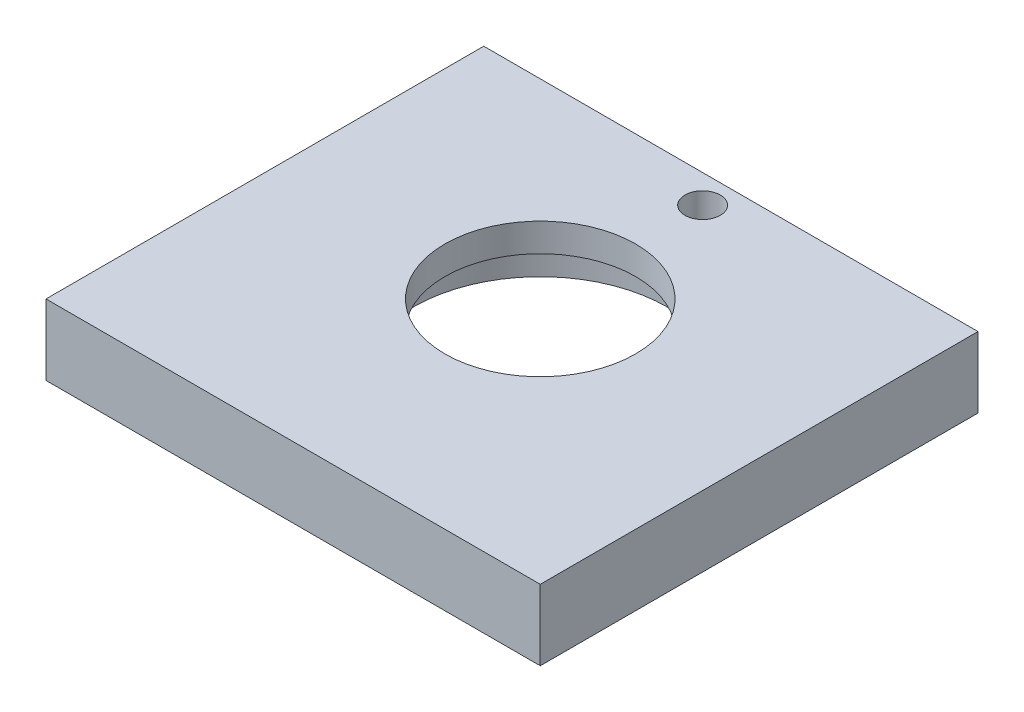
from build123d import *

# Parameters (mm, degrees)
ESQUISSE1_W               = 70
ESQUISSE1_H               = 10
BOSS_EXTRU_1_DEPTH        = 62
ESQUISSE2_R               = 13.5
ESQUISSE2_R_2             = 2.5
ENL_V_MAT_EXTRU_1_DEPTH   = 62
TROU_TARAUD_M5X0_81_D     = 4.2
TROU_TARAUD_M5X0_81_DEPTH = 15
TROU_TARAUD_M5X0_81_TIP   = 1.2618073
ESQUISSE5_R               = 18
ENL_V_MAT_EXTRU_2_DEPTH   = 6


with BuildPart() as part:
    # Esquisse1 → Boss.-Extru.1 (new body)
    with BuildSketch(Plane.XY):
        with Locations((-45, 130)):
            Rectangle(ESQUISSE1_W, ESQUISSE1_H)
    extrude(amount=BOSS_EXTRU_1_DEPTH)

    # Esquisse2 → Enl_v. mat.-Extru.1 (cut)
    with BuildSketch(Plane(origin=(0, 135, 0), x_dir=(1, 0, 0), z_dir=(0, 1, 0))):
        with Locations(Location((-45, -27, 0), (0, 0, 270))):
            Circle(ESQUISSE2_R)
        with Locations(Location((-45, -4, 0), (0, 0, 270))):
            Circle(ESQUISSE2_R_2)
    extrude(amount=-ENL_V_MAT_EXTRU_1_DEPTH, mode=Mode.SUBTRACT)

    # Trou taraud_ M5x0.81
    with Locations(Plane(origin=(0, 0, 0), x_dir=(-1, 0, 0), z_dir=(0, 0, -1))):
        with Locations((20, 130), (70, 130)):
            Hole(TROU_TARAUD_M5X0_81_D / 2, depth=TROU_TARAUD_M5X0_81_DEPTH)
            with Locations((0, 0, -(TROU_TARAUD_M5X0_81_DEPTH + TROU_TARAUD_M5X0_81_TIP / 2))):  # 118° drill point
                Cone(0, TROU_TARAUD_M5X0_81_D / 2, TROU_TARAUD_M5X0_81_TIP, mode=Mode.SUBTRACT)

    # Esquisse5 → Enl_v. mat.-Extru.2 (cut)
    with BuildSketch(Plane.XZ.offset(-125)):
        with Locations(Location((-45, 27, 0), (0, 0, 270))):
            Circle(ESQUISSE5_R)
    extrude(amount=-ENL_V_MAT_EXTRU_2_DEPTH, mode=Mode.SUBTRACT)


solid = part.part
